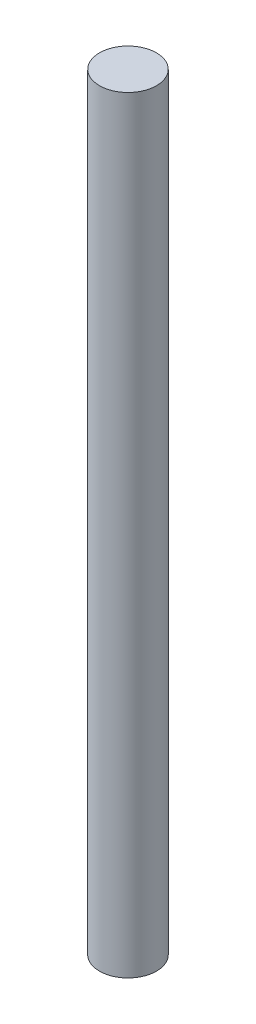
ISO-10303-21;
HEADER;
FILE_DESCRIPTION(('STEP AP214'),'2;1');
FILE_NAME('part.step','',(''),(''),'','','');
FILE_SCHEMA(('AUTOMOTIVE_DESIGN { 1 0 10303 214 1 1 1 1 }'));
ENDSEC;
DATA;
#1=APPLICATION_CONTEXT('core data for automotive mechanical design processes');
#2=APPLICATION_PROTOCOL_DEFINITION('international standard','automotive_design',2000,#1);
#3=PRODUCT_CONTEXT('',#1,'mechanical');
#4=PRODUCT('Part','Part','',(#3));
#5=PRODUCT_RELATED_PRODUCT_CATEGORY('part','',(#4));
#6=PRODUCT_DEFINITION_FORMATION('','',#4);
#7=PRODUCT_DEFINITION_CONTEXT('part definition',#1,'design');
#8=PRODUCT_DEFINITION('design','',#6,#7);
#9=PRODUCT_DEFINITION_SHAPE('','',#8);
#10=(LENGTH_UNIT() NAMED_UNIT(*) SI_UNIT(.MILLI.,.METRE.));
#11=(NAMED_UNIT(*) PLANE_ANGLE_UNIT() SI_UNIT($,.RADIAN.));
#12=(NAMED_UNIT(*) SI_UNIT($,.STERADIAN.) SOLID_ANGLE_UNIT());
#13=UNCERTAINTY_MEASURE_WITH_UNIT(LENGTH_MEASURE(1.E-05),#10,'distance_accuracy_value','');
#14=(GEOMETRIC_REPRESENTATION_CONTEXT(3) GLOBAL_UNCERTAINTY_ASSIGNED_CONTEXT((#13)) GLOBAL_UNIT_ASSIGNED_CONTEXT((#10,
#11,#12)) REPRESENTATION_CONTEXT('',''));
#15=CARTESIAN_POINT('',(0.,0.,0.));
#16=DIRECTION('',(0.,0.,1.));
#17=DIRECTION('',(1.,0.,0.));
#18=AXIS2_PLACEMENT_3D('',#15,#16,#17);
#19=CARTESIAN_POINT('',(0.,44.45,0.));
#20=DIRECTION('',(0.,-1.,0.));
#21=DIRECTION('',(0.,0.,-1.));
#22=AXIS2_PLACEMENT_3D('',#19,#20,#21);
#23=CYLINDRICAL_SURFACE('',#22,1.651);
#24=CARTESIAN_POINT('',(0.,44.45,0.));
#25=DIRECTION('',(0.,1.,0.));
#26=DIRECTION('',(0.,0.,1.));
#27=AXIS2_PLACEMENT_3D('',#24,#25,#26);
#28=CIRCLE('',#27,1.651);
#29=CARTESIAN_POINT('',(0.,44.45,1.651));
#30=VERTEX_POINT('',#29);
#31=EDGE_CURVE('E10',#30,#30,#28,.T.);
#32=ORIENTED_EDGE('',*,*,#31,.F.);
#33=EDGE_LOOP('',(#32));
#34=FACE_BOUND('',#33,.T.);
#35=CARTESIAN_POINT('',(0.,0.,0.));
#36=DIRECTION('',(0.,1.,0.));
#37=DIRECTION('',(0.,0.,1.));
#38=AXIS2_PLACEMENT_3D('',#35,#36,#37);
#39=CIRCLE('',#38,1.651);
#40=CARTESIAN_POINT('',(0.,0.,1.651));
#41=VERTEX_POINT('',#40);
#42=EDGE_CURVE('E36',#41,#41,#39,.T.);
#43=ORIENTED_EDGE('',*,*,#42,.T.);
#44=EDGE_LOOP('',(#43));
#45=FACE_BOUND('',#44,.T.);
#46=ADVANCED_FACE('F33',(#34,#45),#23,.T.);
#47=CARTESIAN_POINT('',(0.,44.45,0.));
#48=DIRECTION('',(0.,1.,0.));
#49=DIRECTION('',(0.,0.,1.));
#50=AXIS2_PLACEMENT_3D('',#47,#48,#49);
#51=PLANE('',#50);
#52=ORIENTED_EDGE('',*,*,#31,.T.);
#53=EDGE_LOOP('',(#52));
#54=FACE_BOUND('',#53,.T.);
#55=ADVANCED_FACE('F48',(#54),#51,.T.);
#56=CARTESIAN_POINT('',(0.,0.,0.));
#57=DIRECTION('',(0.,1.,0.));
#58=DIRECTION('',(0.,0.,1.));
#59=AXIS2_PLACEMENT_3D('',#56,#57,#58);
#60=PLANE('',#59);
#61=ORIENTED_EDGE('',*,*,#42,.F.);
#62=EDGE_LOOP('',(#61));
#63=FACE_BOUND('',#62,.T.);
#64=ADVANCED_FACE('F46',(#63),#60,.F.);
#65=CLOSED_SHELL('',(#46,#55,#64));
#66=MANIFOLD_SOLID_BREP('B2',#65);
#67=ADVANCED_BREP_SHAPE_REPRESENTATION('',(#18,#66),#14);
#68=SHAPE_DEFINITION_REPRESENTATION(#9,#67);
ENDSEC;
END-ISO-10303-21;
